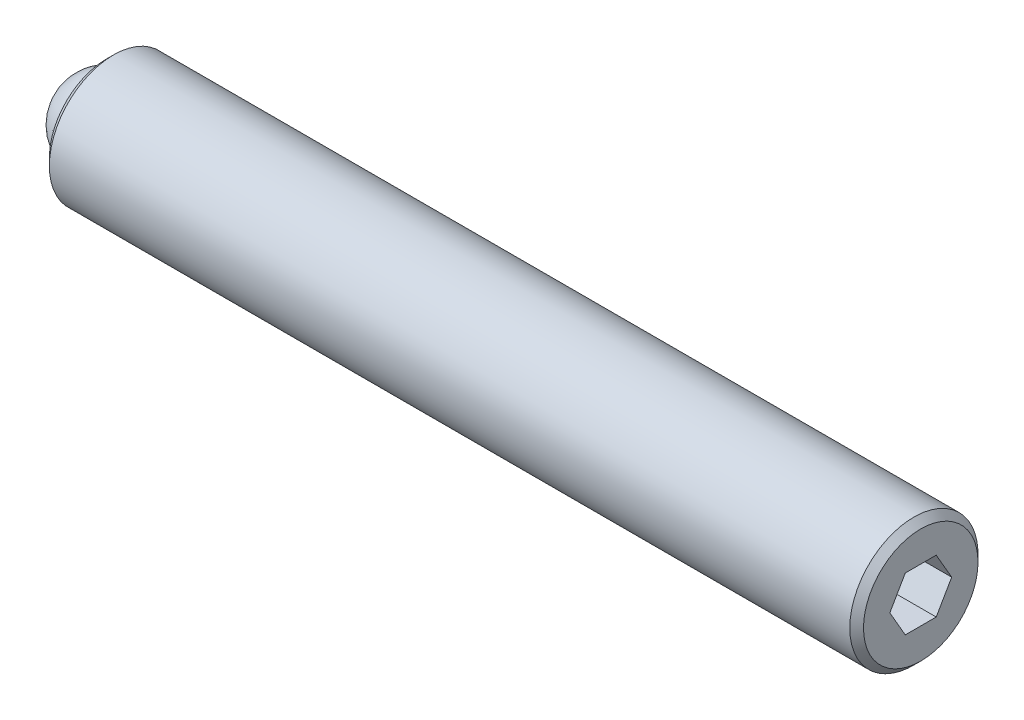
from build123d import *

# Parameters (mm, degrees)
SKETCH2_R           = 2.3749
BOSS_EXTRUDE1_DEPTH = 30.1625
CHAMFER1_SIZE       = 0.254
CHAMFER2_SIZE       = 0.254
CUT_EXTRUDE2_DEPTH  = 2.286
SKETCH3_R           = 1.5875
CUT_EXTRUDE3_DEPTH  = 1.5875


with BuildPart() as part:
    # Sketch2 → Boss-Extrude1 (new body)
    with BuildSketch(Plane(origin=(0, 0, 0), x_dir=(0, 0, -1), z_dir=(1, 0, 0))):
        with Locations(Location((0, 0, 0), (0, 0, 180))):
            Circle(SKETCH2_R)
    extrude(amount=BOSS_EXTRUDE1_DEPTH)

    # Chamfer1
    chamfer1_edges = [part.edges().sort_by_distance(p)[0] for p in [
        (0, 0, -2.3749),
    ]]
    chamfer(chamfer1_edges, length=CHAMFER1_SIZE)

    # Chamfer2
    chamfer2_edges = [part.edges().sort_by_distance(p)[0] for p in [
        (30.1625, 0, -2.3749),
    ]]
    chamfer(chamfer2_edges, length=CHAMFER2_SIZE)

    # Sketch4 → Cut-Extrude2 (cut)
    with BuildSketch(Plane(origin=(30.1625, 0, 0), x_dir=(0, 0, -1), z_dir=(1, 0, 0))):
        Polygon((1.14567944, 0), (0.57283972, 0.9921875), (-0.57283972, 0.9921875), (-1.14567944, 0), (-0.57283972, -0.9921875), (0.57283972, -0.9921875), align=None)
    extrude(amount=-CUT_EXTRUDE2_DEPTH, mode=Mode.SUBTRACT)

    # Sketch3 → Cut-Extrude3 (cut)
    with BuildSketch(Plane.ZY):
        Circle(SKETCH3_R)
    extrude(amount=-CUT_EXTRUDE3_DEPTH, mode=Mode.SUBTRACT)


with BuildPart() as body_2:
    # Sketch5 → Revolve1 (revolve)
    with BuildSketch(Plane.ZY):
        with BuildLine():
            Line((0, 0), (0, -1.5875))
            ThreePointArc((0, -1.5875), (-1.5875, 0), (0, 1.5875))
            Line((0, 1.5875), (0, 0))
        make_face()
    revolve(axis=Axis((0, 0, 0), (0, 1, 0)))


solid = Compound([part.part, body_2.part])
